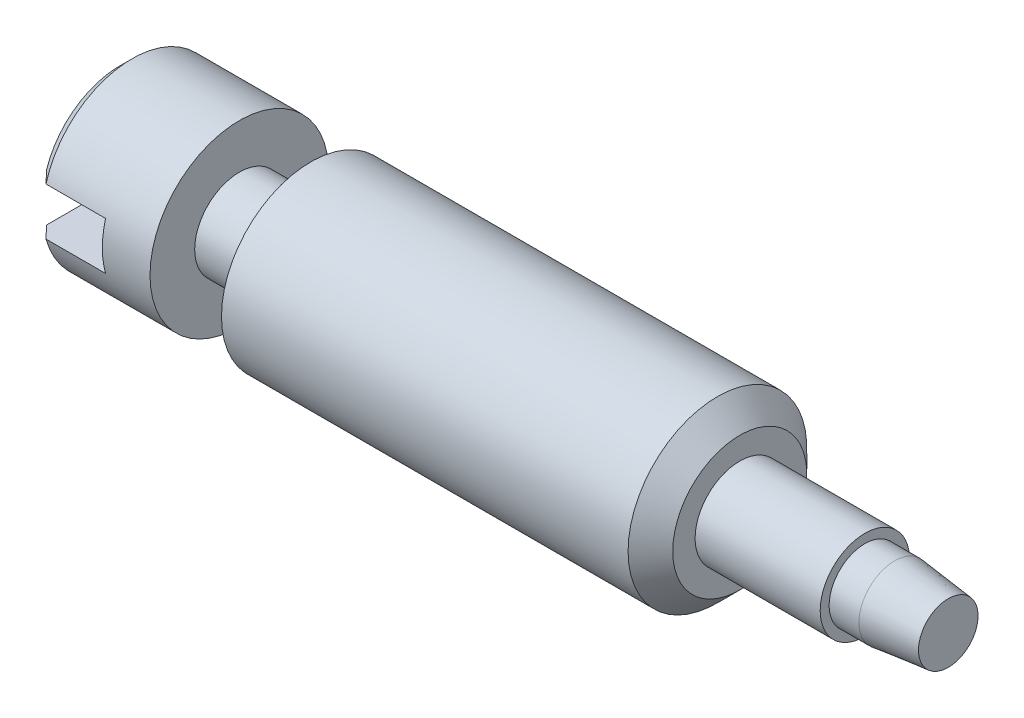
ISO-10303-21;
HEADER;
FILE_DESCRIPTION(('STEP AP214'),'2;1');
FILE_NAME('part.step','',(''),(''),'','','');
FILE_SCHEMA(('AUTOMOTIVE_DESIGN { 1 0 10303 214 1 1 1 1 }'));
ENDSEC;
DATA;
#1=APPLICATION_CONTEXT('core data for automotive mechanical design processes');
#2=APPLICATION_PROTOCOL_DEFINITION('international standard','automotive_design',2000,#1);
#3=PRODUCT_CONTEXT('',#1,'mechanical');
#4=PRODUCT('Part','Part','',(#3));
#5=PRODUCT_RELATED_PRODUCT_CATEGORY('part','',(#4));
#6=PRODUCT_DEFINITION_FORMATION('','',#4);
#7=PRODUCT_DEFINITION_CONTEXT('part definition',#1,'design');
#8=PRODUCT_DEFINITION('design','',#6,#7);
#9=PRODUCT_DEFINITION_SHAPE('','',#8);
#10=(LENGTH_UNIT() NAMED_UNIT(*) SI_UNIT(.MILLI.,.METRE.));
#11=(NAMED_UNIT(*) PLANE_ANGLE_UNIT() SI_UNIT($,.RADIAN.));
#12=(NAMED_UNIT(*) SI_UNIT($,.STERADIAN.) SOLID_ANGLE_UNIT());
#13=UNCERTAINTY_MEASURE_WITH_UNIT(LENGTH_MEASURE(1.E-05),#10,'distance_accuracy_value','');
#14=(GEOMETRIC_REPRESENTATION_CONTEXT(3) GLOBAL_UNCERTAINTY_ASSIGNED_CONTEXT((#13)) GLOBAL_UNIT_ASSIGNED_CONTEXT((#10,
#11,#12)) REPRESENTATION_CONTEXT('',''));
#15=CARTESIAN_POINT('',(0.,0.,0.));
#16=DIRECTION('',(0.,0.,1.));
#17=DIRECTION('',(1.,0.,0.));
#18=AXIS2_PLACEMENT_3D('',#15,#16,#17);
#19=CARTESIAN_POINT('',(0.,0.,0.));
#20=DIRECTION('',(1.,0.,0.));
#21=DIRECTION('',(0.,0.,-1.));
#22=AXIS2_PLACEMENT_3D('',#19,#20,#21);
#23=PLANE('',#22);
#24=DIRECTION('',(0.,0.,1.));
#25=VECTOR('',#24,1.);
#26=CARTESIAN_POINT('',(0.,0.4,-1.5));
#27=LINE('',#26,#25);
#28=CARTESIAN_POINT('',(0.,0.4,-1.2369316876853));
#29=VERTEX_POINT('',#28);
#30=CARTESIAN_POINT('',(0.,0.4,1.2369316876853));
#31=VERTEX_POINT('',#30);
#32=EDGE_CURVE('E506',#29,#31,#27,.T.);
#33=ORIENTED_EDGE('',*,*,#32,.T.);
#34=CARTESIAN_POINT('',(0.,0.,0.));
#35=DIRECTION('',(1.,0.,0.));
#36=DIRECTION('',(0.,0.,-1.));
#37=AXIS2_PLACEMENT_3D('',#34,#35,#36);
#38=CIRCLE('',#37,1.3);
#39=EDGE_CURVE('E454',#31,#29,#38,.F.);
#40=ORIENTED_EDGE('',*,*,#39,.T.);
#41=EDGE_LOOP('',(#33,#40));
#42=FACE_BOUND('',#41,.T.);
#43=ADVANCED_FACE('F362',(#42),#23,.F.);
#44=DIRECTION('',(0.,0.,1.));
#45=VECTOR('',#44,1.);
#46=CARTESIAN_POINT('',(0.,-0.4,-1.5));
#47=LINE('',#46,#45);
#48=CARTESIAN_POINT('',(0.,-0.4,-1.2369316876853));
#49=VERTEX_POINT('',#48);
#50=CARTESIAN_POINT('',(0.,-0.4,1.2369316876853));
#51=VERTEX_POINT('',#50);
#52=EDGE_CURVE('E435',#49,#51,#47,.T.);
#53=ORIENTED_EDGE('',*,*,#52,.F.);
#54=CARTESIAN_POINT('',(0.,0.,0.));
#55=DIRECTION('',(1.,0.,0.));
#56=DIRECTION('',(0.,0.,-1.));
#57=AXIS2_PLACEMENT_3D('',#54,#55,#56);
#58=CIRCLE('',#57,1.3);
#59=EDGE_CURVE('E488',#49,#51,#58,.F.);
#60=ORIENTED_EDGE('',*,*,#59,.T.);
#61=EDGE_LOOP('',(#53,#60));
#62=FACE_BOUND('',#61,.T.);
#63=ADVANCED_FACE('F364',(#62),#23,.F.);
#64=CARTESIAN_POINT('',(-1.61064348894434,0.,0.));
#65=DIRECTION('',(-1.,0.,0.));
#66=DIRECTION('',(0.,0.,1.));
#67=AXIS2_PLACEMENT_3D('',#64,#65,#66);
#68=CYLINDRICAL_SURFACE('',#67,1.5);
#69=DIRECTION('',(-1.,0.,0.));
#70=VECTOR('',#69,1.);
#71=CARTESIAN_POINT('',(-1.61064348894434,0.4,-1.4456832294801));
#72=LINE('',#71,#70);
#73=CARTESIAN_POINT('',(1.2,0.4,-1.4456832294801));
#74=VERTEX_POINT('',#73);
#75=CARTESIAN_POINT('',(0.200000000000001,0.4,-1.4456832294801));
#76=VERTEX_POINT('',#75);
#77=EDGE_CURVE('E450',#74,#76,#72,.T.);
#78=ORIENTED_EDGE('',*,*,#77,.T.);
#79=CARTESIAN_POINT('',(0.200000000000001,0.,0.));
#80=DIRECTION('',(1.,0.,0.));
#81=DIRECTION('',(0.,0.,-1.));
#82=AXIS2_PLACEMENT_3D('',#79,#80,#81);
#83=CIRCLE('',#82,1.5);
#84=CARTESIAN_POINT('',(0.2,0.4,1.4456832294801));
#85=VERTEX_POINT('',#84);
#86=EDGE_CURVE('E512',#76,#85,#83,.T.);
#87=ORIENTED_EDGE('',*,*,#86,.T.);
#88=DIRECTION('',(-1.,0.,0.));
#89=VECTOR('',#88,1.);
#90=CARTESIAN_POINT('',(-1.61064348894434,0.4,1.4456832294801));
#91=LINE('',#90,#89);
#92=CARTESIAN_POINT('',(1.2,0.4,1.4456832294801));
#93=VERTEX_POINT('',#92);
#94=EDGE_CURVE('E441',#85,#93,#91,.F.);
#95=ORIENTED_EDGE('',*,*,#94,.T.);
#96=CARTESIAN_POINT('',(1.2,0.,0.));
#97=DIRECTION('',(1.,0.,0.));
#98=DIRECTION('',(0.,0.,-1.));
#99=AXIS2_PLACEMENT_3D('',#96,#97,#98);
#100=CIRCLE('',#99,1.5);
#101=CARTESIAN_POINT('',(1.2,-0.4,1.4456832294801));
#102=VERTEX_POINT('',#101);
#103=EDGE_CURVE('E427',#93,#102,#100,.T.);
#104=ORIENTED_EDGE('',*,*,#103,.T.);
#105=DIRECTION('',(-1.,0.,0.));
#106=VECTOR('',#105,1.);
#107=CARTESIAN_POINT('',(-1.61064348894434,-0.4,1.4456832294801));
#108=LINE('',#107,#106);
#109=CARTESIAN_POINT('',(0.200000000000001,-0.4,1.4456832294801));
#110=VERTEX_POINT('',#109);
#111=EDGE_CURVE('E419',#102,#110,#108,.T.);
#112=ORIENTED_EDGE('',*,*,#111,.T.);
#113=CARTESIAN_POINT('',(0.200000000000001,0.,0.));
#114=DIRECTION('',(1.,0.,0.));
#115=DIRECTION('',(0.,0.,-1.));
#116=AXIS2_PLACEMENT_3D('',#113,#114,#115);
#117=CIRCLE('',#116,1.5);
#118=CARTESIAN_POINT('',(0.2,-0.4,-1.4456832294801));
#119=VERTEX_POINT('',#118);
#120=EDGE_CURVE('E513',#110,#119,#117,.T.);
#121=ORIENTED_EDGE('',*,*,#120,.T.);
#122=DIRECTION('',(-1.,0.,0.));
#123=VECTOR('',#122,1.);
#124=CARTESIAN_POINT('',(-1.61064348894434,-0.4,-1.4456832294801));
#125=LINE('',#124,#123);
#126=CARTESIAN_POINT('',(1.2,-0.4,-1.4456832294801));
#127=VERTEX_POINT('',#126);
#128=EDGE_CURVE('E447',#119,#127,#125,.F.);
#129=ORIENTED_EDGE('',*,*,#128,.T.);
#130=EDGE_CURVE('E426',#127,#74,#100,.T.);
#131=ORIENTED_EDGE('',*,*,#130,.T.);
#132=EDGE_LOOP('',(#78,#87,#95,#104,#112,#121,#129,#131));
#133=FACE_BOUND('',#132,.T.);
#134=CARTESIAN_POINT('',(2.,0.,0.));
#135=DIRECTION('',(-1.,0.,0.));
#136=DIRECTION('',(0.,0.,1.));
#137=AXIS2_PLACEMENT_3D('',#134,#135,#136);
#138=CIRCLE('',#137,1.5);
#139=CARTESIAN_POINT('',(2.,0.,1.5));
#140=VERTEX_POINT('',#139);
#141=EDGE_CURVE('E540',#140,#140,#138,.T.);
#142=ORIENTED_EDGE('',*,*,#141,.T.);
#143=EDGE_LOOP('',(#142));
#144=FACE_BOUND('',#143,.T.);
#145=ADVANCED_FACE('F438',(#133,#144),#68,.T.);
#146=CARTESIAN_POINT('',(2.,1.5,0.));
#147=DIRECTION('',(-1.,0.,0.));
#148=DIRECTION('',(0.,0.,1.));
#149=AXIS2_PLACEMENT_3D('',#146,#147,#148);
#150=PLANE('',#149);
#151=ORIENTED_EDGE('',*,*,#141,.F.);
#152=EDGE_LOOP('',(#151));
#153=FACE_BOUND('',#152,.T.);
#154=CARTESIAN_POINT('',(2.,0.,0.));
#155=DIRECTION('',(-1.,0.,0.));
#156=DIRECTION('',(0.,0.,1.));
#157=AXIS2_PLACEMENT_3D('',#154,#155,#156);
#158=CIRCLE('',#157,0.749999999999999);
#159=CARTESIAN_POINT('',(2.,0.,0.749999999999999));
#160=VERTEX_POINT('',#159);
#161=EDGE_CURVE('E537',#160,#160,#158,.T.);
#162=ORIENTED_EDGE('',*,*,#161,.T.);
#163=EDGE_LOOP('',(#162));
#164=FACE_BOUND('',#163,.T.);
#165=ADVANCED_FACE('F599',(#153,#164),#150,.F.);
#166=CARTESIAN_POINT('',(-1.61064348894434,0.,0.));
#167=DIRECTION('',(-1.,0.,0.));
#168=DIRECTION('',(0.,0.,1.));
#169=AXIS2_PLACEMENT_3D('',#166,#167,#168);
#170=CYLINDRICAL_SURFACE('',#169,0.749999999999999);
#171=ORIENTED_EDGE('',*,*,#161,.F.);
#172=EDGE_LOOP('',(#171));
#173=FACE_BOUND('',#172,.T.);
#174=CARTESIAN_POINT('',(3.2,0.,0.));
#175=DIRECTION('',(-1.,0.,0.));
#176=DIRECTION('',(0.,0.,1.));
#177=AXIS2_PLACEMENT_3D('',#174,#175,#176);
#178=CIRCLE('',#177,0.749999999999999);
#179=CARTESIAN_POINT('',(3.2,0.,0.749999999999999));
#180=VERTEX_POINT('',#179);
#181=EDGE_CURVE('E534',#180,#180,#178,.T.);
#182=ORIENTED_EDGE('',*,*,#181,.T.);
#183=EDGE_LOOP('',(#182));
#184=FACE_BOUND('',#183,.T.);
#185=ADVANCED_FACE('F595',(#173,#184),#170,.T.);
#186=CARTESIAN_POINT('',(3.2,0.749999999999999,0.));
#187=DIRECTION('',(1.,0.,0.));
#188=DIRECTION('',(0.,0.,-1.));
#189=AXIS2_PLACEMENT_3D('',#186,#187,#188);
#190=PLANE('',#189);
#191=ORIENTED_EDGE('',*,*,#181,.F.);
#192=EDGE_LOOP('',(#191));
#193=FACE_BOUND('',#192,.T.);
#194=CARTESIAN_POINT('',(3.2,0.,0.));
#195=DIRECTION('',(-1.,0.,0.));
#196=DIRECTION('',(0.,0.,1.));
#197=AXIS2_PLACEMENT_3D('',#194,#195,#196);
#198=CIRCLE('',#197,1.5);
#199=CARTESIAN_POINT('',(3.2,0.,1.5));
#200=VERTEX_POINT('',#199);
#201=EDGE_CURVE('E531',#200,#200,#198,.T.);
#202=ORIENTED_EDGE('',*,*,#201,.T.);
#203=EDGE_LOOP('',(#202));
#204=FACE_BOUND('',#203,.T.);
#205=ADVANCED_FACE('F592',(#193,#204),#190,.F.);
#206=CARTESIAN_POINT('',(-1.61064348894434,0.,0.));
#207=DIRECTION('',(-1.,0.,0.));
#208=DIRECTION('',(0.,0.,1.));
#209=AXIS2_PLACEMENT_3D('',#206,#207,#208);
#210=CYLINDRICAL_SURFACE('',#209,1.5);
#211=CARTESIAN_POINT('',(10.025,0.,0.));
#212=DIRECTION('',(-1.,0.,0.));
#213=DIRECTION('',(0.,0.,1.));
#214=AXIS2_PLACEMENT_3D('',#211,#212,#213);
#215=CIRCLE('',#214,1.5);
#216=CARTESIAN_POINT('',(10.025,0.,1.5));
#217=VERTEX_POINT('',#216);
#218=EDGE_CURVE('E445',#217,#217,#215,.T.);
#219=ORIENTED_EDGE('',*,*,#218,.T.);
#220=EDGE_LOOP('',(#219));
#221=FACE_BOUND('',#220,.T.);
#222=ORIENTED_EDGE('',*,*,#201,.F.);
#223=EDGE_LOOP('',(#222));
#224=FACE_BOUND('',#223,.T.);
#225=ADVANCED_FACE('F546',(#221,#224),#210,.T.);
#226=CARTESIAN_POINT('',(10.4,1.5,0.));
#227=DIRECTION('',(-1.,0.,0.));
#228=DIRECTION('',(0.,0.,1.));
#229=AXIS2_PLACEMENT_3D('',#226,#227,#228);
#230=PLANE('',#229);
#231=CARTESIAN_POINT('',(10.4,0.,0.));
#232=DIRECTION('',(-1.,0.,0.));
#233=DIRECTION('',(0.,0.,1.));
#234=AXIS2_PLACEMENT_3D('',#231,#232,#233);
#235=CIRCLE('',#234,1.125);
#236=CARTESIAN_POINT('',(10.4,0.,1.125));
#237=VERTEX_POINT('',#236);
#238=EDGE_CURVE('E442',#237,#237,#235,.F.);
#239=ORIENTED_EDGE('',*,*,#238,.T.);
#240=EDGE_LOOP('',(#239));
#241=FACE_BOUND('',#240,.T.);
#242=CARTESIAN_POINT('',(10.4,0.,0.));
#243=DIRECTION('',(-1.,0.,0.));
#244=DIRECTION('',(0.,0.,1.));
#245=AXIS2_PLACEMENT_3D('',#242,#243,#244);
#246=CIRCLE('',#245,0.750000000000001);
#247=CARTESIAN_POINT('',(10.4,0.,0.750000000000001));
#248=VERTEX_POINT('',#247);
#249=EDGE_CURVE('E528',#248,#248,#246,.T.);
#250=ORIENTED_EDGE('',*,*,#249,.T.);
#251=EDGE_LOOP('',(#250));
#252=FACE_BOUND('',#251,.T.);
#253=ADVANCED_FACE('F559',(#241,#252),#230,.F.);
#254=CARTESIAN_POINT('',(-1.61064348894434,0.,0.));
#255=DIRECTION('',(-1.,0.,0.));
#256=DIRECTION('',(0.,0.,1.));
#257=AXIS2_PLACEMENT_3D('',#254,#255,#256);
#258=CYLINDRICAL_SURFACE('',#257,0.750000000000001);
#259=ORIENTED_EDGE('',*,*,#249,.F.);
#260=EDGE_LOOP('',(#259));
#261=FACE_BOUND('',#260,.T.);
#262=CARTESIAN_POINT('',(12.5,0.,0.));
#263=DIRECTION('',(-1.,0.,0.));
#264=DIRECTION('',(0.,0.,1.));
#265=AXIS2_PLACEMENT_3D('',#262,#263,#264);
#266=CIRCLE('',#265,0.750000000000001);
#267=CARTESIAN_POINT('',(12.5,0.,0.750000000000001));
#268=VERTEX_POINT('',#267);
#269=EDGE_CURVE('E525',#268,#268,#266,.T.);
#270=ORIENTED_EDGE('',*,*,#269,.T.);
#271=EDGE_LOOP('',(#270));
#272=FACE_BOUND('',#271,.T.);
#273=ADVANCED_FACE('F562',(#261,#272),#258,.T.);
#274=CARTESIAN_POINT('',(12.5,0.750000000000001,0.));
#275=DIRECTION('',(-1.,0.,0.));
#276=DIRECTION('',(0.,0.,1.));
#277=AXIS2_PLACEMENT_3D('',#274,#275,#276);
#278=PLANE('',#277);
#279=ORIENTED_EDGE('',*,*,#269,.F.);
#280=EDGE_LOOP('',(#279));
#281=FACE_BOUND('',#280,.T.);
#282=CARTESIAN_POINT('',(12.5,0.,0.));
#283=DIRECTION('',(-1.,0.,0.));
#284=DIRECTION('',(0.,0.,1.));
#285=AXIS2_PLACEMENT_3D('',#282,#283,#284);
#286=CIRCLE('',#285,0.6);
#287=CARTESIAN_POINT('',(12.5,0.,0.6));
#288=VERTEX_POINT('',#287);
#289=EDGE_CURVE('E522',#288,#288,#286,.T.);
#290=ORIENTED_EDGE('',*,*,#289,.T.);
#291=EDGE_LOOP('',(#290));
#292=FACE_BOUND('',#291,.T.);
#293=ADVANCED_FACE('F568',(#281,#292),#278,.F.);
#294=CARTESIAN_POINT('',(-1.61064348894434,0.,0.));
#295=DIRECTION('',(-1.,0.,0.));
#296=DIRECTION('',(0.,0.,1.));
#297=AXIS2_PLACEMENT_3D('',#294,#295,#296);
#298=CYLINDRICAL_SURFACE('',#297,0.6);
#299=ORIENTED_EDGE('',*,*,#289,.F.);
#300=EDGE_LOOP('',(#299));
#301=FACE_BOUND('',#300,.T.);
#302=CARTESIAN_POINT('',(13.,0.,0.));
#303=DIRECTION('',(-1.,0.,0.));
#304=DIRECTION('',(0.,0.,1.));
#305=AXIS2_PLACEMENT_3D('',#302,#303,#304);
#306=CIRCLE('',#305,0.6);
#307=CARTESIAN_POINT('',(13.,0.,0.6));
#308=VERTEX_POINT('',#307);
#309=EDGE_CURVE('E519',#308,#308,#306,.T.);
#310=ORIENTED_EDGE('',*,*,#309,.T.);
#311=EDGE_LOOP('',(#310));
#312=FACE_BOUND('',#311,.T.);
#313=ADVANCED_FACE('F574',(#301,#312),#298,.T.);
#314=CARTESIAN_POINT('',(13.9,0.,0.));
#315=DIRECTION('',(-1.,0.,0.));
#316=DIRECTION('',(0.,0.,1.));
#317=AXIS2_PLACEMENT_3D('',#314,#315,#316);
#318=CONICAL_SURFACE('',#317,0.5,0.110657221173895);
#319=ORIENTED_EDGE('',*,*,#309,.F.);
#320=EDGE_LOOP('',(#319));
#321=FACE_BOUND('',#320,.T.);
#322=CARTESIAN_POINT('',(13.9,0.,0.));
#323=DIRECTION('',(-1.,0.,0.));
#324=DIRECTION('',(0.,0.,1.));
#325=AXIS2_PLACEMENT_3D('',#322,#323,#324);
#326=CIRCLE('',#325,0.5);
#327=CARTESIAN_POINT('',(13.9,0.,0.5));
#328=VERTEX_POINT('',#327);
#329=EDGE_CURVE('E508',#328,#328,#326,.T.);
#330=ORIENTED_EDGE('',*,*,#329,.T.);
#331=EDGE_LOOP('',(#330));
#332=FACE_BOUND('',#331,.T.);
#333=ADVANCED_FACE('F555',(#321,#332),#318,.T.);
#334=CARTESIAN_POINT('',(13.9,0.5,0.));
#335=DIRECTION('',(-1.,0.,0.));
#336=DIRECTION('',(0.,0.,1.));
#337=AXIS2_PLACEMENT_3D('',#334,#335,#336);
#338=PLANE('',#337);
#339=ORIENTED_EDGE('',*,*,#329,.F.);
#340=EDGE_LOOP('',(#339));
#341=FACE_BOUND('',#340,.T.);
#342=ADVANCED_FACE('F550',(#341),#338,.F.);
#343=CARTESIAN_POINT('',(10.025,0.,0.));
#344=DIRECTION('',(-1.,0.,0.));
#345=DIRECTION('',(0.,0.,1.));
#346=AXIS2_PLACEMENT_3D('',#343,#344,#345);
#347=CONICAL_SURFACE('',#346,1.5,0.785398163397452);
#348=ORIENTED_EDGE('',*,*,#238,.F.);
#349=EDGE_LOOP('',(#348));
#350=FACE_BOUND('',#349,.T.);
#351=ORIENTED_EDGE('',*,*,#218,.F.);
#352=EDGE_LOOP('',(#351));
#353=FACE_BOUND('',#352,.T.);
#354=ADVANCED_FACE('F475',(#350,#353),#347,.T.);
#355=CARTESIAN_POINT('',(0.,0.4,-1.5));
#356=DIRECTION('',(0.,1.,0.));
#357=DIRECTION('',(-1.,0.,0.));
#358=AXIS2_PLACEMENT_3D('',#355,#356,#357);
#359=PLANE('',#358);
#360=ORIENTED_EDGE('',*,*,#32,.F.);
#361=CARTESIAN_POINT('',(0.,0.4,-1.2369316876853));
#362=CARTESIAN_POINT('',(0.0332223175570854,0.4,-1.27182998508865));
#363=CARTESIAN_POINT('',(0.0665001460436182,0.4,-1.30667509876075));
#364=CARTESIAN_POINT('',(0.133166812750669,0.4,-1.37625894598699));
#365=CARTESIAN_POINT('',(0.166555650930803,0.4,-1.41099767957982));
#366=CARTESIAN_POINT('',(0.200000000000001,0.4,-1.4456832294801));
#367=B_SPLINE_CURVE_WITH_KNOTS('',3,(#361,#362,#363,#364,#365,#366),.UNSPECIFIED.,.F.,.F.,(4,2,
4),(0.,0.144548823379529,0.289097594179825),.UNSPECIFIED.);
#368=EDGE_CURVE('E464',#29,#76,#367,.T.);
#369=ORIENTED_EDGE('',*,*,#368,.T.);
#370=ORIENTED_EDGE('',*,*,#77,.F.);
#371=DIRECTION('',(0.,0.,1.));
#372=VECTOR('',#371,1.);
#373=CARTESIAN_POINT('',(1.2,0.4,-1.5));
#374=LINE('',#373,#372);
#375=EDGE_CURVE('E434',#74,#93,#374,.T.);
#376=ORIENTED_EDGE('',*,*,#375,.T.);
#377=ORIENTED_EDGE('',*,*,#94,.F.);
#378=CARTESIAN_POINT('',(0.200000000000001,0.4,1.4456832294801));
#379=CARTESIAN_POINT('',(0.166555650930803,0.4,1.41099767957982));
#380=CARTESIAN_POINT('',(0.133166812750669,0.4,1.37625894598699));
#381=CARTESIAN_POINT('',(0.0665001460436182,0.4,1.30667509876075));
#382=CARTESIAN_POINT('',(0.0332223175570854,0.4,1.27182998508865));
#383=CARTESIAN_POINT('',(0.,0.4,1.2369316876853));
#384=B_SPLINE_CURVE_WITH_KNOTS('',3,(#378,#379,#380,#381,#382,#383),.UNSPECIFIED.,.F.,.F.,(4,2,
4),(0.,0.144548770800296,0.289097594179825),.UNSPECIFIED.);
#385=EDGE_CURVE('E457',#85,#31,#384,.T.);
#386=ORIENTED_EDGE('',*,*,#385,.T.);
#387=EDGE_LOOP('',(#360,#369,#370,#376,#377,#386));
#388=FACE_BOUND('',#387,.T.);
#389=ADVANCED_FACE('F471',(#388),#359,.F.);
#390=CARTESIAN_POINT('',(1.2,0.4,-1.5));
#391=DIRECTION('',(1.,0.,0.));
#392=DIRECTION('',(0.,0.,-1.));
#393=AXIS2_PLACEMENT_3D('',#390,#391,#392);
#394=PLANE('',#393);
#395=ORIENTED_EDGE('',*,*,#375,.F.);
#396=ORIENTED_EDGE('',*,*,#130,.F.);
#397=DIRECTION('',(0.,0.,1.));
#398=VECTOR('',#397,1.);
#399=CARTESIAN_POINT('',(1.2,-0.4,-1.5));
#400=LINE('',#399,#398);
#401=EDGE_CURVE('E422',#127,#102,#400,.T.);
#402=ORIENTED_EDGE('',*,*,#401,.T.);
#403=ORIENTED_EDGE('',*,*,#103,.F.);
#404=EDGE_LOOP('',(#395,#396,#402,#403));
#405=FACE_BOUND('',#404,.T.);
#406=ADVANCED_FACE('F432',(#405),#394,.F.);
#407=CARTESIAN_POINT('',(0.,-0.4,-1.5));
#408=DIRECTION('',(0.,-1.,0.));
#409=DIRECTION('',(1.,0.,0.));
#410=AXIS2_PLACEMENT_3D('',#407,#408,#409);
#411=PLANE('',#410);
#412=ORIENTED_EDGE('',*,*,#52,.T.);
#413=CARTESIAN_POINT('',(0.,-0.4,1.2369316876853));
#414=CARTESIAN_POINT('',(0.0332223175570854,-0.4,1.27182998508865));
#415=CARTESIAN_POINT('',(0.0665001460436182,-0.4,1.30667509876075));
#416=CARTESIAN_POINT('',(0.133166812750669,-0.4,1.37625894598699));
#417=CARTESIAN_POINT('',(0.166555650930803,-0.4,1.41099767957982));
#418=CARTESIAN_POINT('',(0.200000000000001,-0.4,1.4456832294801));
#419=B_SPLINE_CURVE_WITH_KNOTS('',3,(#413,#414,#415,#416,#417,#418),.UNSPECIFIED.,.F.,.F.,(4,2,
4),(0.,0.144548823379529,0.289097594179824),.UNSPECIFIED.);
#420=EDGE_CURVE('E11',#51,#110,#419,.T.);
#421=ORIENTED_EDGE('',*,*,#420,.T.);
#422=ORIENTED_EDGE('',*,*,#111,.F.);
#423=ORIENTED_EDGE('',*,*,#401,.F.);
#424=ORIENTED_EDGE('',*,*,#128,.F.);
#425=CARTESIAN_POINT('',(0.200000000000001,-0.4,-1.4456832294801));
#426=CARTESIAN_POINT('',(0.166555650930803,-0.4,-1.41099767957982));
#427=CARTESIAN_POINT('',(0.133166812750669,-0.4,-1.37625894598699));
#428=CARTESIAN_POINT('',(0.0665001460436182,-0.4,-1.30667509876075));
#429=CARTESIAN_POINT('',(0.0332223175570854,-0.4,-1.27182998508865));
#430=CARTESIAN_POINT('',(0.,-0.4,-1.2369316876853));
#431=B_SPLINE_CURVE_WITH_KNOTS('',3,(#425,#426,#427,#428,#429,#430),.UNSPECIFIED.,.F.,.F.,(4,2,
4),(0.,0.144548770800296,0.289097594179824),.UNSPECIFIED.);
#432=EDGE_CURVE('E375',#119,#49,#431,.T.);
#433=ORIENTED_EDGE('',*,*,#432,.T.);
#434=EDGE_LOOP('',(#412,#421,#422,#423,#424,#433));
#435=FACE_BOUND('',#434,.T.);
#436=ADVANCED_FACE('F421',(#435),#411,.F.);
#437=CARTESIAN_POINT('',(0.,0.,0.));
#438=DIRECTION('',(1.,0.,0.));
#439=DIRECTION('',(0.,0.,-1.));
#440=AXIS2_PLACEMENT_3D('',#437,#438,#439);
#441=CONICAL_SURFACE('',#440,1.3,0.785398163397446);
#442=ORIENTED_EDGE('',*,*,#385,.F.);
#443=ORIENTED_EDGE('',*,*,#86,.F.);
#444=ORIENTED_EDGE('',*,*,#368,.F.);
#445=ORIENTED_EDGE('',*,*,#39,.F.);
#446=EDGE_LOOP('',(#442,#443,#444,#445));
#447=FACE_BOUND('',#446,.T.);
#448=ADVANCED_FACE('F469',(#447),#441,.T.);
#449=CARTESIAN_POINT('',(0.,0.,0.));
#450=DIRECTION('',(1.,0.,0.));
#451=DIRECTION('',(0.,0.,-1.));
#452=AXIS2_PLACEMENT_3D('',#449,#450,#451);
#453=CONICAL_SURFACE('',#452,1.3,0.785398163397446);
#454=ORIENTED_EDGE('',*,*,#432,.F.);
#455=ORIENTED_EDGE('',*,*,#120,.F.);
#456=ORIENTED_EDGE('',*,*,#420,.F.);
#457=ORIENTED_EDGE('',*,*,#59,.F.);
#458=EDGE_LOOP('',(#454,#455,#456,#457));
#459=FACE_BOUND('',#458,.T.);
#460=ADVANCED_FACE('F490',(#459),#453,.T.);
#461=CLOSED_SHELL('',(#43,#63,#145,#165,#185,#205,#225,#253,#273,#293,#313,#333,#342,#354,#389,
#406,#436,#448,#460));
#462=MANIFOLD_SOLID_BREP('B2',#461);
#463=ADVANCED_BREP_SHAPE_REPRESENTATION('',(#18,#462),#14);
#464=SHAPE_DEFINITION_REPRESENTATION(#9,#463);
ENDSEC;
END-ISO-10303-21;
